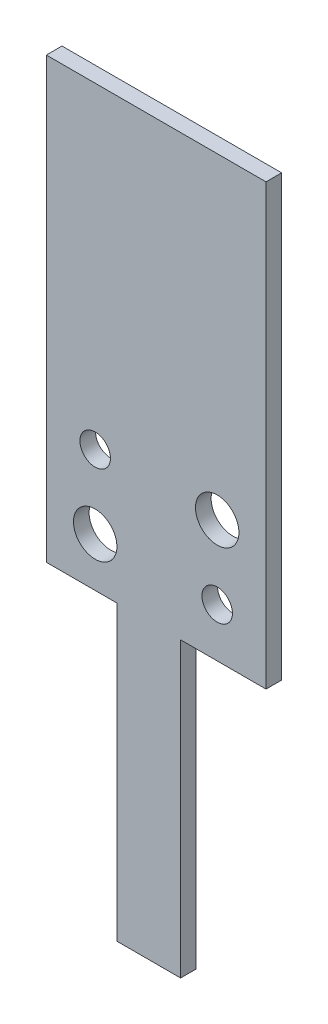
ISO-10303-21;
HEADER;
FILE_DESCRIPTION(('STEP AP214'),'2;1');
FILE_NAME('part.step','',(''),(''),'','','');
FILE_SCHEMA(('AUTOMOTIVE_DESIGN { 1 0 10303 214 1 1 1 1 }'));
ENDSEC;
DATA;
#1=APPLICATION_CONTEXT('core data for automotive mechanical design processes');
#2=APPLICATION_PROTOCOL_DEFINITION('international standard','automotive_design',2000,#1);
#3=PRODUCT_CONTEXT('',#1,'mechanical');
#4=PRODUCT('Part','Part','',(#3));
#5=PRODUCT_RELATED_PRODUCT_CATEGORY('part','',(#4));
#6=PRODUCT_DEFINITION_FORMATION('','',#4);
#7=PRODUCT_DEFINITION_CONTEXT('part definition',#1,'design');
#8=PRODUCT_DEFINITION('design','',#6,#7);
#9=PRODUCT_DEFINITION_SHAPE('','',#8);
#10=(LENGTH_UNIT() NAMED_UNIT(*) SI_UNIT(.MILLI.,.METRE.));
#11=(NAMED_UNIT(*) PLANE_ANGLE_UNIT() SI_UNIT($,.RADIAN.));
#12=(NAMED_UNIT(*) SI_UNIT($,.STERADIAN.) SOLID_ANGLE_UNIT());
#13=UNCERTAINTY_MEASURE_WITH_UNIT(LENGTH_MEASURE(1.E-05),#10,'distance_accuracy_value','');
#14=(GEOMETRIC_REPRESENTATION_CONTEXT(3) GLOBAL_UNCERTAINTY_ASSIGNED_CONTEXT((#13)) GLOBAL_UNIT_ASSIGNED_CONTEXT((#10,
#11,#12)) REPRESENTATION_CONTEXT('',''));
#15=CARTESIAN_POINT('',(0.,0.,0.));
#16=DIRECTION('',(0.,0.,1.));
#17=DIRECTION('',(1.,0.,0.));
#18=AXIS2_PLACEMENT_3D('',#15,#16,#17);
#19=CARTESIAN_POINT('',(-5.334,35.56,0.8128));
#20=DIRECTION('',(1.,0.,0.));
#21=DIRECTION('',(0.,1.,0.));
#22=AXIS2_PLACEMENT_3D('',#19,#20,#21);
#23=PLANE('',#22);
#24=DIRECTION('',(0.,-1.,0.));
#25=VECTOR('',#24,1.);
#26=CARTESIAN_POINT('',(-5.334,35.56,0.));
#27=LINE('',#26,#25);
#28=CARTESIAN_POINT('',(-5.334,35.56,0.));
#29=VERTEX_POINT('',#28);
#30=CARTESIAN_POINT('',(-5.334,12.7,0.));
#31=VERTEX_POINT('',#30);
#32=EDGE_CURVE('E130',#29,#31,#27,.T.);
#33=ORIENTED_EDGE('',*,*,#32,.T.);
#34=DIRECTION('',(0.,0.,1.));
#35=VECTOR('',#34,1.);
#36=CARTESIAN_POINT('',(-5.334,12.7,0.));
#37=LINE('',#36,#35);
#38=CARTESIAN_POINT('',(-5.334,12.7,0.8128));
#39=VERTEX_POINT('',#38);
#40=EDGE_CURVE('E139',#31,#39,#37,.T.);
#41=ORIENTED_EDGE('',*,*,#40,.T.);
#42=DIRECTION('',(0.,-1.,0.));
#43=VECTOR('',#42,1.);
#44=CARTESIAN_POINT('',(-5.334,35.56,0.8128));
#45=LINE('',#44,#43);
#46=CARTESIAN_POINT('',(-5.334,35.56,0.8128));
#47=VERTEX_POINT('',#46);
#48=EDGE_CURVE('E120',#47,#39,#45,.T.);
#49=ORIENTED_EDGE('',*,*,#48,.F.);
#50=DIRECTION('',(0.,0.,-1.));
#51=VECTOR('',#50,1.);
#52=CARTESIAN_POINT('',(-5.334,35.56,0.8128));
#53=LINE('',#52,#51);
#54=EDGE_CURVE('E37',#47,#29,#53,.T.);
#55=ORIENTED_EDGE('',*,*,#54,.T.);
#56=EDGE_LOOP('',(#33,#41,#49,#55));
#57=FACE_BOUND('',#56,.T.);
#58=ADVANCED_FACE('F30',(#57),#23,.F.);
#59=CARTESIAN_POINT('',(-5.334,-2.54,0.8128));
#60=DIRECTION('',(0.,1.,0.));
#61=DIRECTION('',(-1.,0.,0.));
#62=AXIS2_PLACEMENT_3D('',#59,#60,#61);
#63=PLANE('',#62);
#64=DIRECTION('',(1.,0.,0.));
#65=VECTOR('',#64,1.);
#66=CARTESIAN_POINT('',(-5.334,-2.54,0.));
#67=LINE('',#66,#65);
#68=CARTESIAN_POINT('',(-1.651,-2.54,0.));
#69=VERTEX_POINT('',#68);
#70=CARTESIAN_POINT('',(1.651,-2.54,0.));
#71=VERTEX_POINT('',#70);
#72=EDGE_CURVE('E138',#69,#71,#67,.T.);
#73=ORIENTED_EDGE('',*,*,#72,.T.);
#74=DIRECTION('',(0.,0.,1.));
#75=VECTOR('',#74,1.);
#76=CARTESIAN_POINT('',(1.651,-2.54,0.));
#77=LINE('',#76,#75);
#78=CARTESIAN_POINT('',(1.651,-2.54,0.8128));
#79=VERTEX_POINT('',#78);
#80=EDGE_CURVE('E176',#71,#79,#77,.T.);
#81=ORIENTED_EDGE('',*,*,#80,.T.);
#82=DIRECTION('',(1.,0.,0.));
#83=VECTOR('',#82,1.);
#84=CARTESIAN_POINT('',(-5.334,-2.54,0.8128));
#85=LINE('',#84,#83);
#86=CARTESIAN_POINT('',(-1.651,-2.54,0.8128));
#87=VERTEX_POINT('',#86);
#88=EDGE_CURVE('E117',#87,#79,#85,.T.);
#89=ORIENTED_EDGE('',*,*,#88,.F.);
#90=DIRECTION('',(0.,0.,1.));
#91=VECTOR('',#90,1.);
#92=CARTESIAN_POINT('',(-1.651,-2.54,0.));
#93=LINE('',#92,#91);
#94=EDGE_CURVE('E147',#69,#87,#93,.T.);
#95=ORIENTED_EDGE('',*,*,#94,.F.);
#96=EDGE_LOOP('',(#73,#81,#89,#95));
#97=FACE_BOUND('',#96,.T.);
#98=ADVANCED_FACE('F163',(#97),#63,.F.);
#99=CARTESIAN_POINT('',(6.096,35.56,0.8128));
#100=DIRECTION('',(-1.,0.,0.));
#101=DIRECTION('',(0.,-1.,0.));
#102=AXIS2_PLACEMENT_3D('',#99,#100,#101);
#103=PLANE('',#102);
#104=DIRECTION('',(0.,1.,0.));
#105=VECTOR('',#104,1.);
#106=CARTESIAN_POINT('',(6.096,35.56,0.8128));
#107=LINE('',#106,#105);
#108=CARTESIAN_POINT('',(6.096,12.7,0.8128));
#109=VERTEX_POINT('',#108);
#110=CARTESIAN_POINT('',(6.096,35.56,0.8128));
#111=VERTEX_POINT('',#110);
#112=EDGE_CURVE('E108',#109,#111,#107,.T.);
#113=ORIENTED_EDGE('',*,*,#112,.F.);
#114=DIRECTION('',(0.,0.,1.));
#115=VECTOR('',#114,1.);
#116=CARTESIAN_POINT('',(6.096,12.7,0.));
#117=LINE('',#116,#115);
#118=CARTESIAN_POINT('',(6.096,12.7,0.));
#119=VERTEX_POINT('',#118);
#120=EDGE_CURVE('E94',#119,#109,#117,.T.);
#121=ORIENTED_EDGE('',*,*,#120,.F.);
#122=DIRECTION('',(0.,1.,0.));
#123=VECTOR('',#122,1.);
#124=CARTESIAN_POINT('',(6.096,35.56,0.));
#125=LINE('',#124,#123);
#126=CARTESIAN_POINT('',(6.096,35.56,0.));
#127=VERTEX_POINT('',#126);
#128=EDGE_CURVE('E142',#119,#127,#125,.T.);
#129=ORIENTED_EDGE('',*,*,#128,.T.);
#130=DIRECTION('',(0.,0.,-1.));
#131=VECTOR('',#130,1.);
#132=CARTESIAN_POINT('',(6.096,35.56,0.8128));
#133=LINE('',#132,#131);
#134=EDGE_CURVE('E11',#111,#127,#133,.T.);
#135=ORIENTED_EDGE('',*,*,#134,.F.);
#136=EDGE_LOOP('',(#113,#121,#129,#135));
#137=FACE_BOUND('',#136,.T.);
#138=ADVANCED_FACE('F114',(#137),#103,.F.);
#139=CARTESIAN_POINT('',(-5.334,35.56,0.8128));
#140=DIRECTION('',(0.,-1.,0.));
#141=DIRECTION('',(0.,0.,-1.));
#142=AXIS2_PLACEMENT_3D('',#139,#140,#141);
#143=PLANE('',#142);
#144=DIRECTION('',(-1.,0.,0.));
#145=VECTOR('',#144,1.);
#146=CARTESIAN_POINT('',(-5.334,35.56,0.));
#147=LINE('',#146,#145);
#148=EDGE_CURVE('E136',#127,#29,#147,.T.);
#149=ORIENTED_EDGE('',*,*,#148,.T.);
#150=ORIENTED_EDGE('',*,*,#54,.F.);
#151=DIRECTION('',(-1.,0.,0.));
#152=VECTOR('',#151,1.);
#153=CARTESIAN_POINT('',(-5.334,35.56,0.8128));
#154=LINE('',#153,#152);
#155=EDGE_CURVE('E116',#111,#47,#154,.T.);
#156=ORIENTED_EDGE('',*,*,#155,.F.);
#157=ORIENTED_EDGE('',*,*,#134,.T.);
#158=EDGE_LOOP('',(#149,#150,#156,#157));
#159=FACE_BOUND('',#158,.T.);
#160=ADVANCED_FACE('F154',(#159),#143,.F.);
#161=CARTESIAN_POINT('',(-5.334,35.56,0.8128));
#162=DIRECTION('',(0.,0.,1.));
#163=DIRECTION('',(1.,0.,0.));
#164=AXIS2_PLACEMENT_3D('',#161,#162,#163);
#165=PLANE('',#164);
#166=CARTESIAN_POINT('',(-2.794,19.05,0.812800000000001));
#167=DIRECTION('',(0.,0.,1.));
#168=DIRECTION('',(1.,0.,0.));
#169=AXIS2_PLACEMENT_3D('',#166,#167,#168);
#170=CIRCLE('',#169,0.793749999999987);
#171=CARTESIAN_POINT('',(-2.00025000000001,19.05,0.812800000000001));
#172=VERTEX_POINT('',#171);
#173=EDGE_CURVE('E236',#172,#172,#170,.T.);
#174=ORIENTED_EDGE('',*,*,#173,.F.);
#175=EDGE_LOOP('',(#174));
#176=FACE_BOUND('',#175,.T.);
#177=CARTESIAN_POINT('',(3.556,15.24,0.812800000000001));
#178=DIRECTION('',(0.,0.,1.));
#179=DIRECTION('',(1.,0.,0.));
#180=AXIS2_PLACEMENT_3D('',#177,#178,#179);
#181=CIRCLE('',#180,0.793749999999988);
#182=CARTESIAN_POINT('',(4.34974999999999,15.24,0.812800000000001));
#183=VERTEX_POINT('',#182);
#184=EDGE_CURVE('E232',#183,#183,#181,.T.);
#185=ORIENTED_EDGE('',*,*,#184,.F.);
#186=EDGE_LOOP('',(#185));
#187=FACE_BOUND('',#186,.T.);
#188=CARTESIAN_POINT('',(-2.794,15.24,0.812800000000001));
#189=DIRECTION('',(0.,0.,1.));
#190=DIRECTION('',(1.,0.,0.));
#191=AXIS2_PLACEMENT_3D('',#188,#189,#190);
#192=CIRCLE('',#191,1.13029999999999);
#193=CARTESIAN_POINT('',(-1.66370000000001,15.24,0.812800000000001));
#194=VERTEX_POINT('',#193);
#195=EDGE_CURVE('E228',#194,#194,#192,.T.);
#196=ORIENTED_EDGE('',*,*,#195,.F.);
#197=EDGE_LOOP('',(#196));
#198=FACE_BOUND('',#197,.T.);
#199=CARTESIAN_POINT('',(3.556,19.05,0.812800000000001));
#200=DIRECTION('',(0.,0.,1.));
#201=DIRECTION('',(1.,0.,0.));
#202=AXIS2_PLACEMENT_3D('',#199,#200,#201);
#203=CIRCLE('',#202,1.13029999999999);
#204=CARTESIAN_POINT('',(4.68629999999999,19.05,0.812800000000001));
#205=VERTEX_POINT('',#204);
#206=EDGE_CURVE('E222',#205,#205,#203,.T.);
#207=ORIENTED_EDGE('',*,*,#206,.F.);
#208=EDGE_LOOP('',(#207));
#209=FACE_BOUND('',#208,.T.);
#210=DIRECTION('',(0.,-1.,0.));
#211=VECTOR('',#210,1.);
#212=CARTESIAN_POINT('',(1.651,-2.54,0.8128));
#213=LINE('',#212,#211);
#214=CARTESIAN_POINT('',(1.651,12.7,0.8128));
#215=VERTEX_POINT('',#214);
#216=EDGE_CURVE('E111',#215,#79,#213,.T.);
#217=ORIENTED_EDGE('',*,*,#216,.F.);
#218=DIRECTION('',(-1.,0.,0.));
#219=VECTOR('',#218,1.);
#220=CARTESIAN_POINT('',(6.096,12.7,0.8128));
#221=LINE('',#220,#219);
#222=EDGE_CURVE('E97',#109,#215,#221,.T.);
#223=ORIENTED_EDGE('',*,*,#222,.F.);
#224=ORIENTED_EDGE('',*,*,#112,.T.);
#225=ORIENTED_EDGE('',*,*,#155,.T.);
#226=ORIENTED_EDGE('',*,*,#48,.T.);
#227=DIRECTION('',(-1.,0.,0.));
#228=VECTOR('',#227,1.);
#229=CARTESIAN_POINT('',(-5.334,12.7,0.8128));
#230=LINE('',#229,#228);
#231=CARTESIAN_POINT('',(-1.651,12.7,0.8128));
#232=VERTEX_POINT('',#231);
#233=EDGE_CURVE('E153',#232,#39,#230,.T.);
#234=ORIENTED_EDGE('',*,*,#233,.F.);
#235=DIRECTION('',(0.,1.,0.));
#236=VECTOR('',#235,1.);
#237=CARTESIAN_POINT('',(-1.651,-2.54,0.8128));
#238=LINE('',#237,#236);
#239=EDGE_CURVE('E183',#87,#232,#238,.T.);
#240=ORIENTED_EDGE('',*,*,#239,.F.);
#241=ORIENTED_EDGE('',*,*,#88,.T.);
#242=EDGE_LOOP('',(#217,#223,#224,#225,#226,#234,#240,#241));
#243=FACE_BOUND('',#242,.T.);
#244=ADVANCED_FACE('F107',(#176,#187,#198,#209,#243),#165,.T.);
#245=CARTESIAN_POINT('',(-5.334,35.56,0.));
#246=DIRECTION('',(0.,0.,1.));
#247=DIRECTION('',(1.,0.,0.));
#248=AXIS2_PLACEMENT_3D('',#245,#246,#247);
#249=PLANE('',#248);
#250=CARTESIAN_POINT('',(-2.794,19.05,0.));
#251=DIRECTION('',(0.,0.,1.));
#252=DIRECTION('',(1.,0.,0.));
#253=AXIS2_PLACEMENT_3D('',#250,#251,#252);
#254=CIRCLE('',#253,0.79375);
#255=CARTESIAN_POINT('',(-2.00025,19.05,0.));
#256=VERTEX_POINT('',#255);
#257=EDGE_CURVE('E210',#256,#256,#254,.T.);
#258=ORIENTED_EDGE('',*,*,#257,.T.);
#259=EDGE_LOOP('',(#258));
#260=FACE_BOUND('',#259,.T.);
#261=CARTESIAN_POINT('',(3.556,15.24,0.));
#262=DIRECTION('',(0.,0.,1.));
#263=DIRECTION('',(1.,0.,0.));
#264=AXIS2_PLACEMENT_3D('',#261,#262,#263);
#265=CIRCLE('',#264,0.79375);
#266=CARTESIAN_POINT('',(4.34975,15.24,0.));
#267=VERTEX_POINT('',#266);
#268=EDGE_CURVE('E214',#267,#267,#265,.T.);
#269=ORIENTED_EDGE('',*,*,#268,.T.);
#270=EDGE_LOOP('',(#269));
#271=FACE_BOUND('',#270,.T.);
#272=CARTESIAN_POINT('',(-2.794,15.24,0.));
#273=DIRECTION('',(0.,0.,1.));
#274=DIRECTION('',(1.,0.,0.));
#275=AXIS2_PLACEMENT_3D('',#272,#273,#274);
#276=CIRCLE('',#275,1.1303);
#277=CARTESIAN_POINT('',(-1.6637,15.24,0.));
#278=VERTEX_POINT('',#277);
#279=EDGE_CURVE('E218',#278,#278,#276,.T.);
#280=ORIENTED_EDGE('',*,*,#279,.T.);
#281=EDGE_LOOP('',(#280));
#282=FACE_BOUND('',#281,.T.);
#283=CARTESIAN_POINT('',(3.556,19.05,0.));
#284=DIRECTION('',(0.,0.,1.));
#285=DIRECTION('',(1.,0.,0.));
#286=AXIS2_PLACEMENT_3D('',#283,#284,#285);
#287=CIRCLE('',#286,1.1303);
#288=CARTESIAN_POINT('',(4.6863,19.05,0.));
#289=VERTEX_POINT('',#288);
#290=EDGE_CURVE('E112',#289,#289,#287,.T.);
#291=ORIENTED_EDGE('',*,*,#290,.T.);
#292=EDGE_LOOP('',(#291));
#293=FACE_BOUND('',#292,.T.);
#294=DIRECTION('',(-1.,0.,0.));
#295=VECTOR('',#294,1.);
#296=CARTESIAN_POINT('',(6.096,12.7,0.));
#297=LINE('',#296,#295);
#298=CARTESIAN_POINT('',(1.651,12.7,0.));
#299=VERTEX_POINT('',#298);
#300=EDGE_CURVE('E100',#119,#299,#297,.T.);
#301=ORIENTED_EDGE('',*,*,#300,.T.);
#302=DIRECTION('',(0.,-1.,0.));
#303=VECTOR('',#302,1.);
#304=CARTESIAN_POINT('',(1.651,-2.54,0.));
#305=LINE('',#304,#303);
#306=EDGE_CURVE('E44',#299,#71,#305,.T.);
#307=ORIENTED_EDGE('',*,*,#306,.T.);
#308=ORIENTED_EDGE('',*,*,#72,.F.);
#309=DIRECTION('',(0.,1.,0.));
#310=VECTOR('',#309,1.);
#311=CARTESIAN_POINT('',(-1.651,-2.54,0.));
#312=LINE('',#311,#310);
#313=CARTESIAN_POINT('',(-1.651,12.7,0.));
#314=VERTEX_POINT('',#313);
#315=EDGE_CURVE('E177',#69,#314,#312,.T.);
#316=ORIENTED_EDGE('',*,*,#315,.T.);
#317=DIRECTION('',(-1.,0.,0.));
#318=VECTOR('',#317,1.);
#319=CARTESIAN_POINT('',(-5.334,12.7,0.));
#320=LINE('',#319,#318);
#321=EDGE_CURVE('E52',#314,#31,#320,.T.);
#322=ORIENTED_EDGE('',*,*,#321,.T.);
#323=ORIENTED_EDGE('',*,*,#32,.F.);
#324=ORIENTED_EDGE('',*,*,#148,.F.);
#325=ORIENTED_EDGE('',*,*,#128,.F.);
#326=EDGE_LOOP('',(#301,#307,#308,#316,#322,#323,#324,#325));
#327=FACE_BOUND('',#326,.T.);
#328=ADVANCED_FACE('F135',(#260,#271,#282,#293,#327),#249,.F.);
#329=CARTESIAN_POINT('',(-5.334,12.7,0.));
#330=DIRECTION('',(0.,1.,0.));
#331=DIRECTION('',(0.,0.,1.));
#332=AXIS2_PLACEMENT_3D('',#329,#330,#331);
#333=PLANE('',#332);
#334=ORIENTED_EDGE('',*,*,#233,.T.);
#335=ORIENTED_EDGE('',*,*,#40,.F.);
#336=ORIENTED_EDGE('',*,*,#321,.F.);
#337=DIRECTION('',(0.,0.,1.));
#338=VECTOR('',#337,1.);
#339=CARTESIAN_POINT('',(-1.651,12.7,0.));
#340=LINE('',#339,#338);
#341=EDGE_CURVE('E144',#314,#232,#340,.T.);
#342=ORIENTED_EDGE('',*,*,#341,.T.);
#343=EDGE_LOOP('',(#334,#335,#336,#342));
#344=FACE_BOUND('',#343,.T.);
#345=ADVANCED_FACE('F193',(#344),#333,.F.);
#346=CARTESIAN_POINT('',(-1.651,-2.54,0.));
#347=DIRECTION('',(1.,0.,0.));
#348=DIRECTION('',(0.,0.,-1.));
#349=AXIS2_PLACEMENT_3D('',#346,#347,#348);
#350=PLANE('',#349);
#351=ORIENTED_EDGE('',*,*,#239,.T.);
#352=ORIENTED_EDGE('',*,*,#341,.F.);
#353=ORIENTED_EDGE('',*,*,#315,.F.);
#354=ORIENTED_EDGE('',*,*,#94,.T.);
#355=EDGE_LOOP('',(#351,#352,#353,#354));
#356=FACE_BOUND('',#355,.T.);
#357=ADVANCED_FACE('F190',(#356),#350,.F.);
#358=CARTESIAN_POINT('',(1.651,-2.54,0.));
#359=DIRECTION('',(-1.,0.,0.));
#360=DIRECTION('',(0.,0.,1.));
#361=AXIS2_PLACEMENT_3D('',#358,#359,#360);
#362=PLANE('',#361);
#363=ORIENTED_EDGE('',*,*,#216,.T.);
#364=ORIENTED_EDGE('',*,*,#80,.F.);
#365=ORIENTED_EDGE('',*,*,#306,.F.);
#366=DIRECTION('',(0.,0.,1.));
#367=VECTOR('',#366,1.);
#368=CARTESIAN_POINT('',(1.651,12.7,0.));
#369=LINE('',#368,#367);
#370=EDGE_CURVE('E104',#299,#215,#369,.T.);
#371=ORIENTED_EDGE('',*,*,#370,.T.);
#372=EDGE_LOOP('',(#363,#364,#365,#371));
#373=FACE_BOUND('',#372,.T.);
#374=ADVANCED_FACE('F192',(#373),#362,.F.);
#375=CARTESIAN_POINT('',(6.096,12.7,0.));
#376=DIRECTION('',(0.,1.,0.));
#377=DIRECTION('',(0.,0.,1.));
#378=AXIS2_PLACEMENT_3D('',#375,#376,#377);
#379=PLANE('',#378);
#380=ORIENTED_EDGE('',*,*,#222,.T.);
#381=ORIENTED_EDGE('',*,*,#370,.F.);
#382=ORIENTED_EDGE('',*,*,#300,.F.);
#383=ORIENTED_EDGE('',*,*,#120,.T.);
#384=EDGE_LOOP('',(#380,#381,#382,#383));
#385=FACE_BOUND('',#384,.T.);
#386=ADVANCED_FACE('F96',(#385),#379,.F.);
#387=CARTESIAN_POINT('',(3.556,19.05,0.8128));
#388=DIRECTION('',(0.,0.,1.));
#389=DIRECTION('',(1.,0.,0.));
#390=AXIS2_PLACEMENT_3D('',#387,#388,#389);
#391=CYLINDRICAL_SURFACE('',#390,1.13029999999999);
#392=ORIENTED_EDGE('',*,*,#290,.F.);
#393=EDGE_LOOP('',(#392));
#394=FACE_BOUND('',#393,.T.);
#395=ORIENTED_EDGE('',*,*,#206,.T.);
#396=EDGE_LOOP('',(#395));
#397=FACE_BOUND('',#396,.T.);
#398=ADVANCED_FACE('F248',(#394,#397),#391,.F.);
#399=CARTESIAN_POINT('',(-2.794,15.24,0.8128));
#400=DIRECTION('',(0.,0.,1.));
#401=DIRECTION('',(1.,0.,0.));
#402=AXIS2_PLACEMENT_3D('',#399,#400,#401);
#403=CYLINDRICAL_SURFACE('',#402,1.13029999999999);
#404=ORIENTED_EDGE('',*,*,#279,.F.);
#405=EDGE_LOOP('',(#404));
#406=FACE_BOUND('',#405,.T.);
#407=ORIENTED_EDGE('',*,*,#195,.T.);
#408=EDGE_LOOP('',(#407));
#409=FACE_BOUND('',#408,.T.);
#410=ADVANCED_FACE('F250',(#406,#409),#403,.F.);
#411=CARTESIAN_POINT('',(3.556,15.24,0.8128));
#412=DIRECTION('',(0.,0.,1.));
#413=DIRECTION('',(1.,0.,0.));
#414=AXIS2_PLACEMENT_3D('',#411,#412,#413);
#415=CYLINDRICAL_SURFACE('',#414,0.793749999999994);
#416=ORIENTED_EDGE('',*,*,#268,.F.);
#417=EDGE_LOOP('',(#416));
#418=FACE_BOUND('',#417,.T.);
#419=ORIENTED_EDGE('',*,*,#184,.T.);
#420=EDGE_LOOP('',(#419));
#421=FACE_BOUND('',#420,.T.);
#422=ADVANCED_FACE('F256',(#418,#421),#415,.F.);
#423=CARTESIAN_POINT('',(-2.794,19.05,0.8128));
#424=DIRECTION('',(0.,0.,1.));
#425=DIRECTION('',(1.,0.,0.));
#426=AXIS2_PLACEMENT_3D('',#423,#424,#425);
#427=CYLINDRICAL_SURFACE('',#426,0.793749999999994);
#428=ORIENTED_EDGE('',*,*,#257,.F.);
#429=EDGE_LOOP('',(#428));
#430=FACE_BOUND('',#429,.T.);
#431=ORIENTED_EDGE('',*,*,#173,.T.);
#432=EDGE_LOOP('',(#431));
#433=FACE_BOUND('',#432,.T.);
#434=ADVANCED_FACE('F240',(#430,#433),#427,.F.);
#435=CLOSED_SHELL('',(#58,#98,#138,#160,#244,#328,#345,#357,#374,#386,#398,#410,#422,#434));
#436=MANIFOLD_SOLID_BREP('B2',#435);
#437=ADVANCED_BREP_SHAPE_REPRESENTATION('',(#18,#436),#14);
#438=SHAPE_DEFINITION_REPRESENTATION(#9,#437);
ENDSEC;
END-ISO-10303-21;
